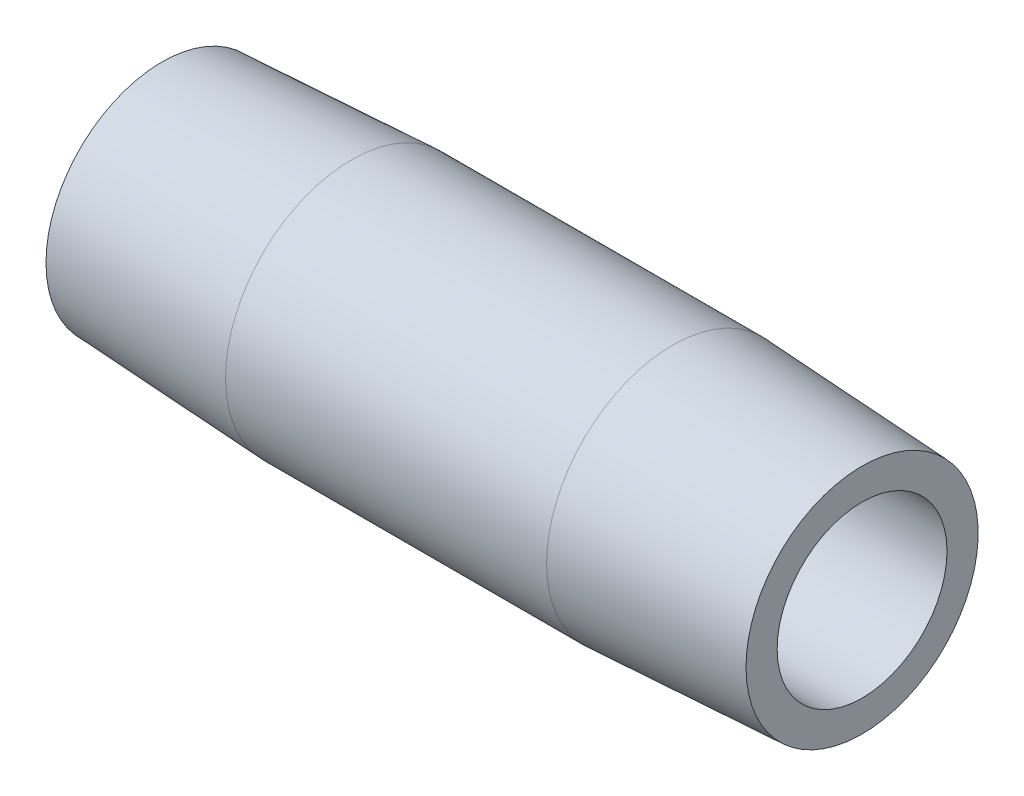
ISO-10303-21;
HEADER;
FILE_DESCRIPTION(('STEP AP214'),'2;1');
FILE_NAME('part.step','',(''),(''),'','','');
FILE_SCHEMA(('AUTOMOTIVE_DESIGN { 1 0 10303 214 1 1 1 1 }'));
ENDSEC;
DATA;
#1=APPLICATION_CONTEXT('core data for automotive mechanical design processes');
#2=APPLICATION_PROTOCOL_DEFINITION('international standard','automotive_design',2000,#1);
#3=PRODUCT_CONTEXT('',#1,'mechanical');
#4=PRODUCT('Part','Part','',(#3));
#5=PRODUCT_RELATED_PRODUCT_CATEGORY('part','',(#4));
#6=PRODUCT_DEFINITION_FORMATION('','',#4);
#7=PRODUCT_DEFINITION_CONTEXT('part definition',#1,'design');
#8=PRODUCT_DEFINITION('design','',#6,#7);
#9=PRODUCT_DEFINITION_SHAPE('','',#8);
#10=(LENGTH_UNIT() NAMED_UNIT(*) SI_UNIT(.MILLI.,.METRE.));
#11=(NAMED_UNIT(*) PLANE_ANGLE_UNIT() SI_UNIT($,.RADIAN.));
#12=(NAMED_UNIT(*) SI_UNIT($,.STERADIAN.) SOLID_ANGLE_UNIT());
#13=UNCERTAINTY_MEASURE_WITH_UNIT(LENGTH_MEASURE(1.E-05),#10,'distance_accuracy_value','');
#14=(GEOMETRIC_REPRESENTATION_CONTEXT(3) GLOBAL_UNCERTAINTY_ASSIGNED_CONTEXT((#13)) GLOBAL_UNIT_ASSIGNED_CONTEXT((#10,
#11,#12)) REPRESENTATION_CONTEXT('',''));
#15=CARTESIAN_POINT('',(0.,0.,0.));
#16=DIRECTION('',(0.,0.,1.));
#17=DIRECTION('',(1.,0.,0.));
#18=AXIS2_PLACEMENT_3D('',#15,#16,#17);
#19=CARTESIAN_POINT('',(38.1,0.,-4.62277681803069));
#20=DIRECTION('',(-1.,0.,0.));
#21=DIRECTION('',(0.,0.,1.));
#22=AXIS2_PLACEMENT_3D('',#19,#20,#21);
#23=PLANE('',#22);
#24=CARTESIAN_POINT('',(38.1,0.,0.));
#25=DIRECTION('',(-1.,0.,0.));
#26=DIRECTION('',(0.,0.,1.));
#27=AXIS2_PLACEMENT_3D('',#24,#25,#26);
#28=CIRCLE('',#27,6.31752683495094);
#29=CARTESIAN_POINT('',(38.1,0.,6.31752683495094));
#30=VERTEX_POINT('',#29);
#31=EDGE_CURVE('E10',#30,#30,#28,.T.);
#32=ORIENTED_EDGE('',*,*,#31,.F.);
#33=EDGE_LOOP('',(#32));
#34=FACE_BOUND('',#33,.T.);
#35=CARTESIAN_POINT('',(38.1,0.,0.));
#36=DIRECTION('',(-1.,0.,0.));
#37=DIRECTION('',(0.,0.,1.));
#38=AXIS2_PLACEMENT_3D('',#35,#36,#37);
#39=CIRCLE('',#38,4.62277681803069);
#40=CARTESIAN_POINT('',(38.1,0.,4.62277681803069));
#41=VERTEX_POINT('',#40);
#42=EDGE_CURVE('E52',#41,#41,#39,.T.);
#43=ORIENTED_EDGE('',*,*,#42,.T.);
#44=EDGE_LOOP('',(#43));
#45=FACE_BOUND('',#44,.T.);
#46=ADVANCED_FACE('F30',(#34,#45),#23,.F.);
#47=CARTESIAN_POINT('',(38.1,0.,0.));
#48=DIRECTION('',(-1.,0.,0.));
#49=DIRECTION('',(0.,0.,1.));
#50=AXIS2_PLACEMENT_3D('',#47,#48,#49);
#51=CONICAL_SURFACE('',#50,6.31752683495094,0.0523598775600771);
#52=CARTESIAN_POINT('',(27.7876000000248,0.,0.));
#53=DIRECTION('',(-1.,0.,0.));
#54=DIRECTION('',(0.,0.,1.));
#55=AXIS2_PLACEMENT_3D('',#52,#53,#54);
#56=CIRCLE('',#55,6.85797681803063);
#57=CARTESIAN_POINT('',(27.7876000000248,0.,6.85797681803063));
#58=VERTEX_POINT('',#57);
#59=EDGE_CURVE('E36',#58,#58,#56,.T.);
#60=ORIENTED_EDGE('',*,*,#59,.F.);
#61=EDGE_LOOP('',(#60));
#62=FACE_BOUND('',#61,.T.);
#63=ORIENTED_EDGE('',*,*,#31,.T.);
#64=EDGE_LOOP('',(#63));
#65=FACE_BOUND('',#64,.T.);
#66=ADVANCED_FACE('F77',(#62,#65),#51,.T.);
#67=CARTESIAN_POINT('',(-6.37599469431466,0.,0.));
#68=DIRECTION('',(-1.,0.,0.));
#69=DIRECTION('',(0.,0.,1.));
#70=AXIS2_PLACEMENT_3D('',#67,#68,#69);
#71=CYLINDRICAL_SURFACE('',#70,6.85797681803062);
#72=CARTESIAN_POINT('',(10.3123999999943,0.,0.));
#73=DIRECTION('',(-1.,0.,0.));
#74=DIRECTION('',(0.,0.,1.));
#75=AXIS2_PLACEMENT_3D('',#72,#73,#74);
#76=CIRCLE('',#75,6.8579768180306);
#77=CARTESIAN_POINT('',(10.3123999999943,0.,6.8579768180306));
#78=VERTEX_POINT('',#77);
#79=EDGE_CURVE('E40',#78,#78,#76,.T.);
#80=ORIENTED_EDGE('',*,*,#79,.F.);
#81=EDGE_LOOP('',(#80));
#82=FACE_BOUND('',#81,.T.);
#83=ORIENTED_EDGE('',*,*,#59,.T.);
#84=EDGE_LOOP('',(#83));
#85=FACE_BOUND('',#84,.T.);
#86=ADVANCED_FACE('F72',(#82,#85),#71,.T.);
#87=CARTESIAN_POINT('',(10.3123999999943,0.,0.));
#88=DIRECTION('',(1.,0.,0.));
#89=DIRECTION('',(0.,0.,-1.));
#90=AXIS2_PLACEMENT_3D('',#87,#88,#89);
#91=CONICAL_SURFACE('',#90,6.8579768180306,0.0523598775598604);
#92=CARTESIAN_POINT('',(1.90819582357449E-11,0.,0.));
#93=DIRECTION('',(-1.,0.,0.));
#94=DIRECTION('',(0.,0.,1.));
#95=AXIS2_PLACEMENT_3D('',#92,#93,#94);
#96=CIRCLE('',#95,6.31752683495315);
#97=CARTESIAN_POINT('',(1.90819582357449E-11,0.,6.31752683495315));
#98=VERTEX_POINT('',#97);
#99=EDGE_CURVE('E44',#98,#98,#96,.T.);
#100=ORIENTED_EDGE('',*,*,#99,.F.);
#101=EDGE_LOOP('',(#100));
#102=FACE_BOUND('',#101,.T.);
#103=ORIENTED_EDGE('',*,*,#79,.T.);
#104=EDGE_LOOP('',(#103));
#105=FACE_BOUND('',#104,.T.);
#106=ADVANCED_FACE('F66',(#102,#105),#91,.T.);
#107=CARTESIAN_POINT('',(1.90819582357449E-11,0.,-6.31752683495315));
#108=DIRECTION('',(1.,0.,0.));
#109=DIRECTION('',(0.,0.,-1.));
#110=AXIS2_PLACEMENT_3D('',#107,#108,#109);
#111=PLANE('',#110);
#112=CARTESIAN_POINT('',(1.90819582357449E-11,0.,0.));
#113=DIRECTION('',(-1.,0.,0.));
#114=DIRECTION('',(0.,0.,1.));
#115=AXIS2_PLACEMENT_3D('',#112,#113,#114);
#116=CIRCLE('',#115,4.62277681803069);
#117=CARTESIAN_POINT('',(1.90819582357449E-11,0.,4.62277681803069));
#118=VERTEX_POINT('',#117);
#119=EDGE_CURVE('E49',#118,#118,#116,.T.);
#120=ORIENTED_EDGE('',*,*,#119,.F.);
#121=EDGE_LOOP('',(#120));
#122=FACE_BOUND('',#121,.T.);
#123=ORIENTED_EDGE('',*,*,#99,.T.);
#124=EDGE_LOOP('',(#123));
#125=FACE_BOUND('',#124,.T.);
#126=ADVANCED_FACE('F60',(#122,#125),#111,.F.);
#127=CARTESIAN_POINT('',(-6.37599469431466,0.,0.));
#128=DIRECTION('',(-1.,0.,0.));
#129=DIRECTION('',(0.,0.,1.));
#130=AXIS2_PLACEMENT_3D('',#127,#128,#129);
#131=CYLINDRICAL_SURFACE('',#130,4.62277681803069);
#132=ORIENTED_EDGE('',*,*,#42,.F.);
#133=EDGE_LOOP('',(#132));
#134=FACE_BOUND('',#133,.T.);
#135=ORIENTED_EDGE('',*,*,#119,.T.);
#136=EDGE_LOOP('',(#135));
#137=FACE_BOUND('',#136,.T.);
#138=ADVANCED_FACE('F57',(#134,#137),#131,.F.);
#139=CLOSED_SHELL('',(#46,#66,#86,#106,#126,#138));
#140=MANIFOLD_SOLID_BREP('B2',#139);
#141=ADVANCED_BREP_SHAPE_REPRESENTATION('',(#18,#140),#14);
#142=SHAPE_DEFINITION_REPRESENTATION(#9,#141);
ENDSEC;
END-ISO-10303-21;
